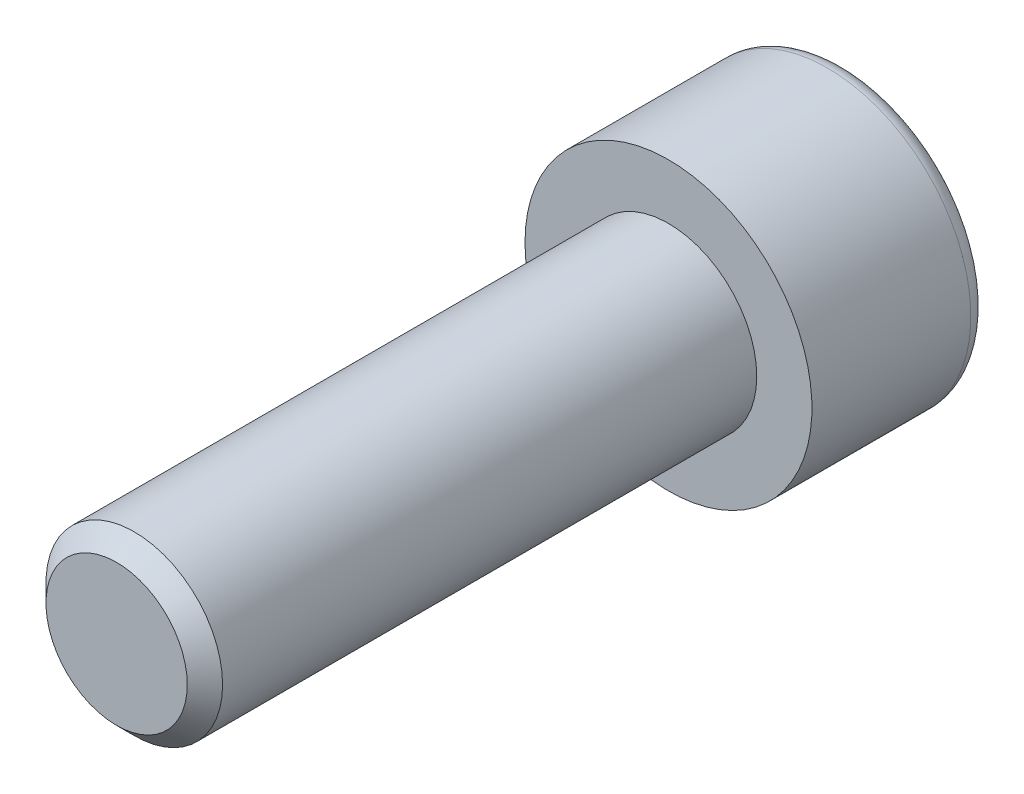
ISO-10303-21;
HEADER;
FILE_DESCRIPTION(('STEP AP214'),'2;1');
FILE_NAME('part.step','',(''),(''),'','','');
FILE_SCHEMA(('AUTOMOTIVE_DESIGN { 1 0 10303 214 1 1 1 1 }'));
ENDSEC;
DATA;
#1=APPLICATION_CONTEXT('core data for automotive mechanical design processes');
#2=APPLICATION_PROTOCOL_DEFINITION('international standard','automotive_design',2000,#1);
#3=PRODUCT_CONTEXT('',#1,'mechanical');
#4=PRODUCT('Part','Part','',(#3));
#5=PRODUCT_RELATED_PRODUCT_CATEGORY('part','',(#4));
#6=PRODUCT_DEFINITION_FORMATION('','',#4);
#7=PRODUCT_DEFINITION_CONTEXT('part definition',#1,'design');
#8=PRODUCT_DEFINITION('design','',#6,#7);
#9=PRODUCT_DEFINITION_SHAPE('','',#8);
#10=(LENGTH_UNIT() NAMED_UNIT(*) SI_UNIT(.MILLI.,.METRE.));
#11=(NAMED_UNIT(*) PLANE_ANGLE_UNIT() SI_UNIT($,.RADIAN.));
#12=(NAMED_UNIT(*) SI_UNIT($,.STERADIAN.) SOLID_ANGLE_UNIT());
#13=UNCERTAINTY_MEASURE_WITH_UNIT(LENGTH_MEASURE(1.E-05),#10,'distance_accuracy_value','');
#14=(GEOMETRIC_REPRESENTATION_CONTEXT(3) GLOBAL_UNCERTAINTY_ASSIGNED_CONTEXT((#13)) GLOBAL_UNIT_ASSIGNED_CONTEXT((#10,
#11,#12)) REPRESENTATION_CONTEXT('',''));
#15=CARTESIAN_POINT('',(0.,0.,0.));
#16=DIRECTION('',(0.,0.,1.));
#17=DIRECTION('',(1.,0.,0.));
#18=AXIS2_PLACEMENT_3D('',#15,#16,#17);
#19=CARTESIAN_POINT('',(0.,0.,-8.));
#20=DIRECTION('',(0.,0.,1.));
#21=DIRECTION('',(1.,0.,0.));
#22=AXIS2_PLACEMENT_3D('',#19,#20,#21);
#23=PLANE('',#22);
#24=CARTESIAN_POINT('',(0.,0.,-8.));
#25=DIRECTION('',(0.,0.,-1.));
#26=DIRECTION('',(-1.,0.,0.));
#27=AXIS2_PLACEMENT_3D('',#24,#25,#26);
#28=CIRCLE('',#27,5.7);
#29=CARTESIAN_POINT('',(-5.7,0.,-8.));
#30=VERTEX_POINT('',#29);
#31=EDGE_CURVE('E141',#30,#30,#28,.T.);
#32=ORIENTED_EDGE('',*,*,#31,.T.);
#33=EDGE_LOOP('',(#32));
#34=FACE_BOUND('',#33,.T.);
#35=DIRECTION('',(-0.86602540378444,0.499999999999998,0.));
#36=VECTOR('',#35,1.);
#37=CARTESIAN_POINT('',(0.,3.46410161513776,-8.));
#38=LINE('',#37,#36);
#39=CARTESIAN_POINT('',(3.,1.73205080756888,-8.));
#40=VERTEX_POINT('',#39);
#41=CARTESIAN_POINT('',(0.,3.46410161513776,-8.));
#42=VERTEX_POINT('',#41);
#43=EDGE_CURVE('E45',#40,#42,#38,.T.);
#44=ORIENTED_EDGE('',*,*,#43,.T.);
#45=DIRECTION('',(-0.866025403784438,-0.500000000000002,0.));
#46=VECTOR('',#45,1.);
#47=CARTESIAN_POINT('',(0.,3.46410161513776,-8.));
#48=LINE('',#47,#46);
#49=CARTESIAN_POINT('',(-3.,1.73205080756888,-8.));
#50=VERTEX_POINT('',#49);
#51=EDGE_CURVE('E85',#42,#50,#48,.T.);
#52=ORIENTED_EDGE('',*,*,#51,.T.);
#53=DIRECTION('',(0.,-1.,0.));
#54=VECTOR('',#53,1.);
#55=CARTESIAN_POINT('',(-3.,-1.73205080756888,-8.));
#56=LINE('',#55,#54);
#57=CARTESIAN_POINT('',(-3.,-1.73205080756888,-8.));
#58=VERTEX_POINT('',#57);
#59=EDGE_CURVE('E93',#50,#58,#56,.T.);
#60=ORIENTED_EDGE('',*,*,#59,.T.);
#61=DIRECTION('',(0.866025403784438,-0.500000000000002,0.));
#62=VECTOR('',#61,1.);
#63=CARTESIAN_POINT('',(0.,-3.46410161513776,-8.));
#64=LINE('',#63,#62);
#65=CARTESIAN_POINT('',(0.,-3.46410161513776,-8.));
#66=VERTEX_POINT('',#65);
#67=EDGE_CURVE('E111',#58,#66,#64,.T.);
#68=ORIENTED_EDGE('',*,*,#67,.T.);
#69=DIRECTION('',(0.86602540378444,0.499999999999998,0.));
#70=VECTOR('',#69,1.);
#71=CARTESIAN_POINT('',(0.,-3.46410161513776,-8.));
#72=LINE('',#71,#70);
#73=CARTESIAN_POINT('',(3.,-1.73205080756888,-8.));
#74=VERTEX_POINT('',#73);
#75=EDGE_CURVE('E114',#66,#74,#72,.T.);
#76=ORIENTED_EDGE('',*,*,#75,.T.);
#77=DIRECTION('',(0.,1.,0.));
#78=VECTOR('',#77,1.);
#79=CARTESIAN_POINT('',(3.,-1.73205080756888,-8.));
#80=LINE('',#79,#78);
#81=EDGE_CURVE('E104',#74,#40,#80,.T.);
#82=ORIENTED_EDGE('',*,*,#81,.T.);
#83=EDGE_LOOP('',(#44,#52,#60,#68,#76,#82));
#84=FACE_BOUND('',#83,.T.);
#85=ADVANCED_FACE('F31',(#34,#84),#23,.F.);
#86=CARTESIAN_POINT('',(0.,0.,-7.2));
#87=DIRECTION('',(0.,0.,-1.));
#88=DIRECTION('',(-1.,0.,0.));
#89=AXIS2_PLACEMENT_3D('',#86,#87,#88);
#90=TOROIDAL_SURFACE('',#89,5.7,0.8);
#91=ORIENTED_EDGE('',*,*,#31,.F.);
#92=EDGE_LOOP('',(#91));
#93=FACE_BOUND('',#92,.T.);
#94=CARTESIAN_POINT('',(0.,0.,-7.2));
#95=DIRECTION('',(0.,0.,-1.));
#96=DIRECTION('',(-1.,0.,0.));
#97=AXIS2_PLACEMENT_3D('',#94,#95,#96);
#98=CIRCLE('',#97,6.5);
#99=CARTESIAN_POINT('',(-6.5,0.,-7.2));
#100=VERTEX_POINT('',#99);
#101=EDGE_CURVE('E138',#100,#100,#98,.T.);
#102=ORIENTED_EDGE('',*,*,#101,.T.);
#103=EDGE_LOOP('',(#102));
#104=FACE_BOUND('',#103,.T.);
#105=ADVANCED_FACE('F160',(#93,#104),#90,.T.);
#106=CARTESIAN_POINT('',(0.,0.,0.));
#107=DIRECTION('',(0.,0.,-1.));
#108=DIRECTION('',(-1.,0.,0.));
#109=AXIS2_PLACEMENT_3D('',#106,#107,#108);
#110=CYLINDRICAL_SURFACE('',#109,6.5);
#111=ORIENTED_EDGE('',*,*,#101,.F.);
#112=EDGE_LOOP('',(#111));
#113=FACE_BOUND('',#112,.T.);
#114=CARTESIAN_POINT('',(0.,0.,0.));
#115=DIRECTION('',(0.,0.,-1.));
#116=DIRECTION('',(-1.,0.,0.));
#117=AXIS2_PLACEMENT_3D('',#114,#115,#116);
#118=CIRCLE('',#117,6.5);
#119=CARTESIAN_POINT('',(-6.5,0.,0.));
#120=VERTEX_POINT('',#119);
#121=EDGE_CURVE('E99',#120,#120,#118,.T.);
#122=ORIENTED_EDGE('',*,*,#121,.T.);
#123=EDGE_LOOP('',(#122));
#124=FACE_BOUND('',#123,.T.);
#125=ADVANCED_FACE('F165',(#113,#124),#110,.T.);
#126=CARTESIAN_POINT('',(0.,0.,0.));
#127=DIRECTION('',(0.,0.,-1.));
#128=DIRECTION('',(-1.,0.,0.));
#129=AXIS2_PLACEMENT_3D('',#126,#127,#128);
#130=PLANE('',#129);
#131=CARTESIAN_POINT('',(0.,0.,0.));
#132=DIRECTION('',(0.,0.,1.));
#133=DIRECTION('',(1.,0.,0.));
#134=AXIS2_PLACEMENT_3D('',#131,#132,#133);
#135=CIRCLE('',#134,4.);
#136=CARTESIAN_POINT('',(4.,0.,0.));
#137=VERTEX_POINT('',#136);
#138=EDGE_CURVE('E105',#137,#137,#135,.T.);
#139=ORIENTED_EDGE('',*,*,#138,.F.);
#140=EDGE_LOOP('',(#139));
#141=FACE_BOUND('',#140,.T.);
#142=ORIENTED_EDGE('',*,*,#121,.F.);
#143=EDGE_LOOP('',(#142));
#144=FACE_BOUND('',#143,.T.);
#145=ADVANCED_FACE('F173',(#141,#144),#130,.F.);
#146=CARTESIAN_POINT('',(0.,3.46410161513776,-4.));
#147=DIRECTION('',(-0.499999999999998,-0.86602540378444,0.));
#148=DIRECTION('',(0.86602540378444,-0.499999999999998,0.));
#149=AXIS2_PLACEMENT_3D('',#146,#147,#148);
#150=PLANE('',#149);
#151=ORIENTED_EDGE('',*,*,#43,.F.);
#152=DIRECTION('',(0.,0.,-1.));
#153=VECTOR('',#152,1.);
#154=CARTESIAN_POINT('',(3.,1.73205080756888,-4.));
#155=LINE('',#154,#153);
#156=CARTESIAN_POINT('',(3.,1.73205080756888,-4.));
#157=VERTEX_POINT('',#156);
#158=EDGE_CURVE('E127',#157,#40,#155,.T.);
#159=ORIENTED_EDGE('',*,*,#158,.F.);
#160=DIRECTION('',(-0.86602540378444,0.499999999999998,0.));
#161=VECTOR('',#160,1.);
#162=CARTESIAN_POINT('',(0.,3.46410161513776,-4.));
#163=LINE('',#162,#161);
#164=CARTESIAN_POINT('',(0.,3.46410161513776,-4.));
#165=VERTEX_POINT('',#164);
#166=EDGE_CURVE('E98',#157,#165,#163,.T.);
#167=ORIENTED_EDGE('',*,*,#166,.T.);
#168=DIRECTION('',(0.,0.,-1.));
#169=VECTOR('',#168,1.);
#170=CARTESIAN_POINT('',(0.,3.46410161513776,-4.));
#171=LINE('',#170,#169);
#172=EDGE_CURVE('E87',#165,#42,#171,.T.);
#173=ORIENTED_EDGE('',*,*,#172,.T.);
#174=EDGE_LOOP('',(#151,#159,#167,#173));
#175=FACE_BOUND('',#174,.T.);
#176=ADVANCED_FACE('F96',(#175),#150,.T.);
#177=CARTESIAN_POINT('',(0.,3.46410161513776,-4.));
#178=DIRECTION('',(0.500000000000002,-0.866025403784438,0.));
#179=DIRECTION('',(0.866025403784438,0.500000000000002,0.));
#180=AXIS2_PLACEMENT_3D('',#177,#178,#179);
#181=PLANE('',#180);
#182=ORIENTED_EDGE('',*,*,#51,.F.);
#183=ORIENTED_EDGE('',*,*,#172,.F.);
#184=DIRECTION('',(-0.866025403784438,-0.500000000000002,0.));
#185=VECTOR('',#184,1.);
#186=CARTESIAN_POINT('',(0.,3.46410161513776,-4.));
#187=LINE('',#186,#185);
#188=CARTESIAN_POINT('',(-3.,1.73205080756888,-4.));
#189=VERTEX_POINT('',#188);
#190=EDGE_CURVE('E118',#165,#189,#187,.T.);
#191=ORIENTED_EDGE('',*,*,#190,.T.);
#192=DIRECTION('',(0.,0.,-1.));
#193=VECTOR('',#192,1.);
#194=CARTESIAN_POINT('',(-3.,1.73205080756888,-4.));
#195=LINE('',#194,#193);
#196=EDGE_CURVE('E89',#189,#50,#195,.T.);
#197=ORIENTED_EDGE('',*,*,#196,.T.);
#198=EDGE_LOOP('',(#182,#183,#191,#197));
#199=FACE_BOUND('',#198,.T.);
#200=ADVANCED_FACE('F86',(#199),#181,.T.);
#201=CARTESIAN_POINT('',(-3.,-1.73205080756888,-4.));
#202=DIRECTION('',(1.,0.,0.));
#203=DIRECTION('',(0.,0.,-1.));
#204=AXIS2_PLACEMENT_3D('',#201,#202,#203);
#205=PLANE('',#204);
#206=ORIENTED_EDGE('',*,*,#59,.F.);
#207=ORIENTED_EDGE('',*,*,#196,.F.);
#208=DIRECTION('',(0.,-1.,0.));
#209=VECTOR('',#208,1.);
#210=CARTESIAN_POINT('',(-3.,-1.73205080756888,-4.));
#211=LINE('',#210,#209);
#212=CARTESIAN_POINT('',(-3.,-1.73205080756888,-4.));
#213=VERTEX_POINT('',#212);
#214=EDGE_CURVE('E120',#189,#213,#211,.T.);
#215=ORIENTED_EDGE('',*,*,#214,.T.);
#216=DIRECTION('',(0.,0.,-1.));
#217=VECTOR('',#216,1.);
#218=CARTESIAN_POINT('',(-3.,-1.73205080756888,-4.));
#219=LINE('',#218,#217);
#220=EDGE_CURVE('E133',#213,#58,#219,.T.);
#221=ORIENTED_EDGE('',*,*,#220,.T.);
#222=EDGE_LOOP('',(#206,#207,#215,#221));
#223=FACE_BOUND('',#222,.T.);
#224=ADVANCED_FACE('F188',(#223),#205,.T.);
#225=CARTESIAN_POINT('',(0.,-3.46410161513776,-4.));
#226=DIRECTION('',(0.500000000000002,0.866025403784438,0.));
#227=DIRECTION('',(-0.866025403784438,0.500000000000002,0.));
#228=AXIS2_PLACEMENT_3D('',#225,#226,#227);
#229=PLANE('',#228);
#230=ORIENTED_EDGE('',*,*,#67,.F.);
#231=ORIENTED_EDGE('',*,*,#220,.F.);
#232=DIRECTION('',(0.866025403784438,-0.500000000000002,0.));
#233=VECTOR('',#232,1.);
#234=CARTESIAN_POINT('',(0.,-3.46410161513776,-4.));
#235=LINE('',#234,#233);
#236=CARTESIAN_POINT('',(0.,-3.46410161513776,-4.));
#237=VERTEX_POINT('',#236);
#238=EDGE_CURVE('E122',#213,#237,#235,.T.);
#239=ORIENTED_EDGE('',*,*,#238,.T.);
#240=DIRECTION('',(0.,0.,-1.));
#241=VECTOR('',#240,1.);
#242=CARTESIAN_POINT('',(0.,-3.46410161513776,-4.));
#243=LINE('',#242,#241);
#244=EDGE_CURVE('E131',#237,#66,#243,.T.);
#245=ORIENTED_EDGE('',*,*,#244,.T.);
#246=EDGE_LOOP('',(#230,#231,#239,#245));
#247=FACE_BOUND('',#246,.T.);
#248=ADVANCED_FACE('F191',(#247),#229,.T.);
#249=CARTESIAN_POINT('',(0.,-3.46410161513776,-4.));
#250=DIRECTION('',(-0.499999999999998,0.86602540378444,0.));
#251=DIRECTION('',(-0.86602540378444,-0.499999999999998,0.));
#252=AXIS2_PLACEMENT_3D('',#249,#250,#251);
#253=PLANE('',#252);
#254=ORIENTED_EDGE('',*,*,#75,.F.);
#255=ORIENTED_EDGE('',*,*,#244,.F.);
#256=DIRECTION('',(0.86602540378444,0.499999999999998,0.));
#257=VECTOR('',#256,1.);
#258=CARTESIAN_POINT('',(0.,-3.46410161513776,-4.));
#259=LINE('',#258,#257);
#260=CARTESIAN_POINT('',(3.,-1.73205080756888,-4.));
#261=VERTEX_POINT('',#260);
#262=EDGE_CURVE('E124',#237,#261,#259,.T.);
#263=ORIENTED_EDGE('',*,*,#262,.T.);
#264=DIRECTION('',(0.,0.,-1.));
#265=VECTOR('',#264,1.);
#266=CARTESIAN_POINT('',(3.,-1.73205080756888,-4.));
#267=LINE('',#266,#265);
#268=EDGE_CURVE('E129',#261,#74,#267,.T.);
#269=ORIENTED_EDGE('',*,*,#268,.T.);
#270=EDGE_LOOP('',(#254,#255,#263,#269));
#271=FACE_BOUND('',#270,.T.);
#272=ADVANCED_FACE('F195',(#271),#253,.T.);
#273=CARTESIAN_POINT('',(3.,-1.73205080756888,-4.));
#274=DIRECTION('',(-1.,0.,0.));
#275=DIRECTION('',(0.,0.,1.));
#276=AXIS2_PLACEMENT_3D('',#273,#274,#275);
#277=PLANE('',#276);
#278=ORIENTED_EDGE('',*,*,#81,.F.);
#279=ORIENTED_EDGE('',*,*,#268,.F.);
#280=DIRECTION('',(0.,1.,0.));
#281=VECTOR('',#280,1.);
#282=CARTESIAN_POINT('',(3.,-1.73205080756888,-4.));
#283=LINE('',#282,#281);
#284=EDGE_CURVE('E52',#261,#157,#283,.T.);
#285=ORIENTED_EDGE('',*,*,#284,.T.);
#286=ORIENTED_EDGE('',*,*,#158,.T.);
#287=EDGE_LOOP('',(#278,#279,#285,#286));
#288=FACE_BOUND('',#287,.T.);
#289=ADVANCED_FACE('F199',(#288),#277,.T.);
#290=CARTESIAN_POINT('',(3.,1.73205080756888,-4.));
#291=DIRECTION('',(0.,0.,1.));
#292=DIRECTION('',(1.,0.,0.));
#293=AXIS2_PLACEMENT_3D('',#290,#291,#292);
#294=PLANE('',#293);
#295=ORIENTED_EDGE('',*,*,#166,.F.);
#296=ORIENTED_EDGE('',*,*,#284,.F.);
#297=ORIENTED_EDGE('',*,*,#262,.F.);
#298=ORIENTED_EDGE('',*,*,#238,.F.);
#299=ORIENTED_EDGE('',*,*,#214,.F.);
#300=ORIENTED_EDGE('',*,*,#190,.F.);
#301=EDGE_LOOP('',(#295,#296,#297,#298,#299,#300));
#302=FACE_BOUND('',#301,.T.);
#303=ADVANCED_FACE('F203',(#302),#294,.F.);
#304=CARTESIAN_POINT('',(0.,0.,25.));
#305=DIRECTION('',(0.,0.,1.));
#306=DIRECTION('',(1.,0.,0.));
#307=AXIS2_PLACEMENT_3D('',#304,#305,#306);
#308=PLANE('',#307);
#309=CARTESIAN_POINT('',(0.,0.,25.));
#310=DIRECTION('',(0.,0.,1.));
#311=DIRECTION('',(1.,0.,0.));
#312=AXIS2_PLACEMENT_3D('',#309,#310,#311);
#313=CIRCLE('',#312,3.2);
#314=CARTESIAN_POINT('',(3.20000000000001,0.,25.));
#315=VERTEX_POINT('',#314);
#316=EDGE_CURVE('E38',#315,#315,#313,.T.);
#317=ORIENTED_EDGE('',*,*,#316,.T.);
#318=EDGE_LOOP('',(#317));
#319=FACE_BOUND('',#318,.T.);
#320=ADVANCED_FACE('F146',(#319),#308,.T.);
#321=CARTESIAN_POINT('',(0.,0.,0.));
#322=DIRECTION('',(0.,0.,1.));
#323=DIRECTION('',(1.,0.,0.));
#324=AXIS2_PLACEMENT_3D('',#321,#322,#323);
#325=CYLINDRICAL_SURFACE('',#324,4.);
#326=CARTESIAN_POINT('',(0.,0.,24.2));
#327=DIRECTION('',(0.,0.,1.));
#328=DIRECTION('',(1.,0.,0.));
#329=AXIS2_PLACEMENT_3D('',#326,#327,#328);
#330=CIRCLE('',#329,4.);
#331=CARTESIAN_POINT('',(4.,0.,24.2));
#332=VERTEX_POINT('',#331);
#333=EDGE_CURVE('E11',#332,#332,#330,.F.);
#334=ORIENTED_EDGE('',*,*,#333,.T.);
#335=EDGE_LOOP('',(#334));
#336=FACE_BOUND('',#335,.T.);
#337=ORIENTED_EDGE('',*,*,#138,.T.);
#338=EDGE_LOOP('',(#337));
#339=FACE_BOUND('',#338,.T.);
#340=ADVANCED_FACE('F150',(#336,#339),#325,.T.);
#341=CARTESIAN_POINT('',(0.,0.,25.));
#342=DIRECTION('',(0.,0.,-1.));
#343=DIRECTION('',(-1.,0.,0.));
#344=AXIS2_PLACEMENT_3D('',#341,#342,#343);
#345=CONICAL_SURFACE('',#344,3.2,0.785398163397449);
#346=ORIENTED_EDGE('',*,*,#333,.F.);
#347=EDGE_LOOP('',(#346));
#348=FACE_BOUND('',#347,.T.);
#349=ORIENTED_EDGE('',*,*,#316,.F.);
#350=EDGE_LOOP('',(#349));
#351=FACE_BOUND('',#350,.T.);
#352=ADVANCED_FACE('F148',(#348,#351),#345,.T.);
#353=CLOSED_SHELL('',(#85,#105,#125,#145,#176,#200,#224,#248,#272,#289,#303,#320,#340,#352));
#354=MANIFOLD_SOLID_BREP('B2',#353);
#355=ADVANCED_BREP_SHAPE_REPRESENTATION('',(#18,#354),#14);
#356=SHAPE_DEFINITION_REPRESENTATION(#9,#355);
ENDSEC;
END-ISO-10303-21;
